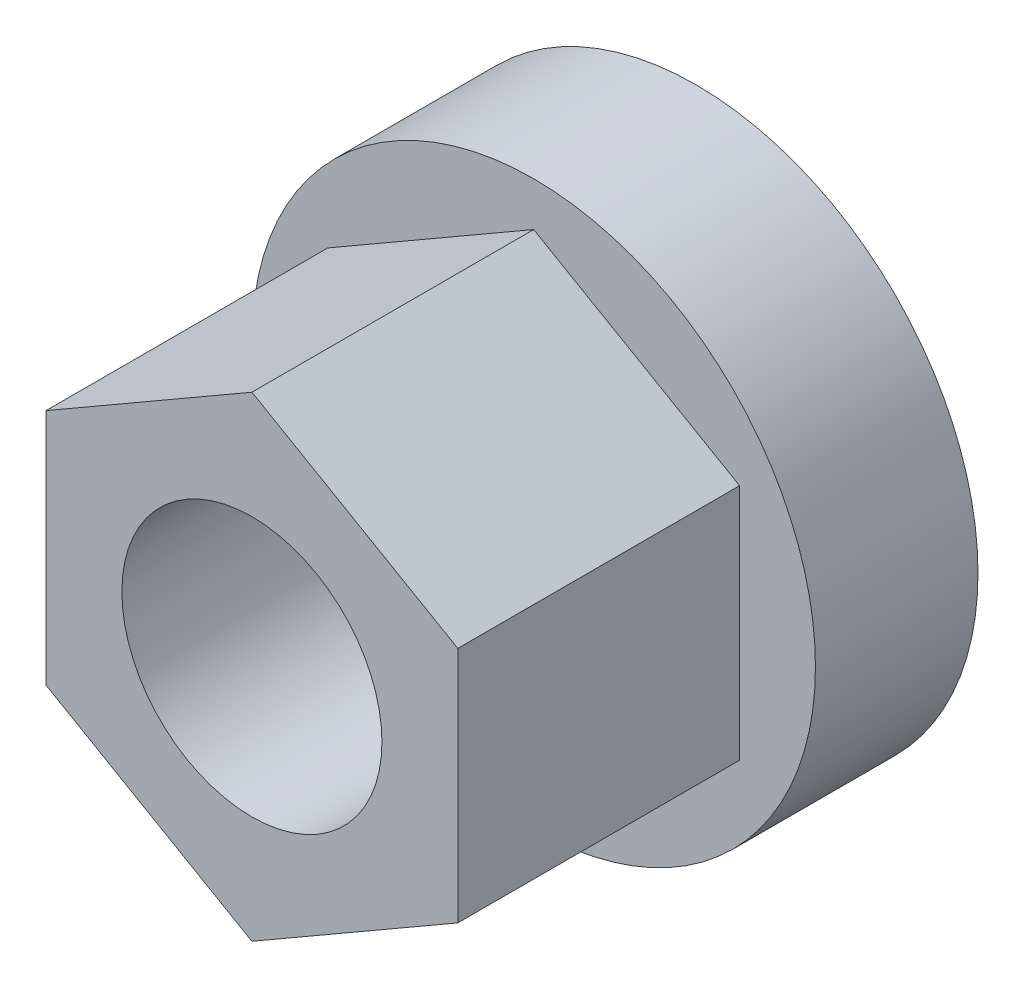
ISO-10303-21;
HEADER;
FILE_DESCRIPTION(('STEP AP214'),'2;1');
FILE_NAME('part.step','',(''),(''),'','','');
FILE_SCHEMA(('AUTOMOTIVE_DESIGN { 1 0 10303 214 1 1 1 1 }'));
ENDSEC;
DATA;
#1=APPLICATION_CONTEXT('core data for automotive mechanical design processes');
#2=APPLICATION_PROTOCOL_DEFINITION('international standard','automotive_design',2000,#1);
#3=PRODUCT_CONTEXT('',#1,'mechanical');
#4=PRODUCT('Part','Part','',(#3));
#5=PRODUCT_RELATED_PRODUCT_CATEGORY('part','',(#4));
#6=PRODUCT_DEFINITION_FORMATION('','',#4);
#7=PRODUCT_DEFINITION_CONTEXT('part definition',#1,'design');
#8=PRODUCT_DEFINITION('design','',#6,#7);
#9=PRODUCT_DEFINITION_SHAPE('','',#8);
#10=(LENGTH_UNIT() NAMED_UNIT(*) SI_UNIT(.MILLI.,.METRE.));
#11=(NAMED_UNIT(*) PLANE_ANGLE_UNIT() SI_UNIT($,.RADIAN.));
#12=(NAMED_UNIT(*) SI_UNIT($,.STERADIAN.) SOLID_ANGLE_UNIT());
#13=UNCERTAINTY_MEASURE_WITH_UNIT(LENGTH_MEASURE(1.E-05),#10,'distance_accuracy_value','');
#14=(GEOMETRIC_REPRESENTATION_CONTEXT(3) GLOBAL_UNCERTAINTY_ASSIGNED_CONTEXT((#13)) GLOBAL_UNIT_ASSIGNED_CONTEXT((#10,
#11,#12)) REPRESENTATION_CONTEXT('',''));
#15=CARTESIAN_POINT('',(0.,0.,0.));
#16=DIRECTION('',(0.,0.,1.));
#17=DIRECTION('',(1.,0.,0.));
#18=AXIS2_PLACEMENT_3D('',#15,#16,#17);
#19=CARTESIAN_POINT('',(-13.,0.,20.5));
#20=DIRECTION('',(0.,0.,-1.));
#21=DIRECTION('',(-1.,0.,0.));
#22=AXIS2_PLACEMENT_3D('',#19,#20,#21);
#23=PLANE('',#22);
#24=CARTESIAN_POINT('',(0.,0.,20.5));
#25=DIRECTION('',(0.,0.,1.));
#26=DIRECTION('',(1.,0.,0.));
#27=AXIS2_PLACEMENT_3D('',#24,#25,#26);
#28=CIRCLE('',#27,6.);
#29=CARTESIAN_POINT('',(6.,0.,20.5));
#30=VERTEX_POINT('',#29);
#31=EDGE_CURVE('E9',#30,#30,#28,.T.);
#32=ORIENTED_EDGE('',*,*,#31,.F.);
#33=EDGE_LOOP('',(#32));
#34=FACE_BOUND('',#33,.T.);
#35=DIRECTION('',(0.86602540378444,-0.5,0.));
#36=VECTOR('',#35,1.);
#37=CARTESIAN_POINT('',(-9.5,-5.4848275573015,20.5));
#38=LINE('',#37,#36);
#39=CARTESIAN_POINT('',(-9.5,-5.4848275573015,20.5));
#40=VERTEX_POINT('',#39);
#41=CARTESIAN_POINT('',(0.,-10.9696551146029,20.5));
#42=VERTEX_POINT('',#41);
#43=EDGE_CURVE('E87',#40,#42,#38,.T.);
#44=ORIENTED_EDGE('',*,*,#43,.T.);
#45=DIRECTION('',(0.866025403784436,0.5,0.));
#46=VECTOR('',#45,1.);
#47=CARTESIAN_POINT('',(0.,-10.9696551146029,20.5));
#48=LINE('',#47,#46);
#49=CARTESIAN_POINT('',(9.5,-5.48482755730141,20.5));
#50=VERTEX_POINT('',#49);
#51=EDGE_CURVE('E85',#42,#50,#48,.T.);
#52=ORIENTED_EDGE('',*,*,#51,.T.);
#53=DIRECTION('',(0.,1.,0.));
#54=VECTOR('',#53,1.);
#55=CARTESIAN_POINT('',(9.5,-5.48482755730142,20.5));
#56=LINE('',#55,#54);
#57=CARTESIAN_POINT('',(9.5,5.48482755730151,20.5));
#58=VERTEX_POINT('',#57);
#59=EDGE_CURVE('E29',#50,#58,#56,.T.);
#60=ORIENTED_EDGE('',*,*,#59,.T.);
#61=DIRECTION('',(-0.866025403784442,0.5,0.));
#62=VECTOR('',#61,1.);
#63=CARTESIAN_POINT('',(9.5,5.48482755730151,20.5));
#64=LINE('',#63,#62);
#65=CARTESIAN_POINT('',(0.,10.9696551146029,20.5));
#66=VERTEX_POINT('',#65);
#67=EDGE_CURVE('E75',#58,#66,#64,.T.);
#68=ORIENTED_EDGE('',*,*,#67,.T.);
#69=DIRECTION('',(-0.86602540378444,-0.5,0.));
#70=VECTOR('',#69,1.);
#71=CARTESIAN_POINT('',(0.,10.9696551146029,20.5));
#72=LINE('',#71,#70);
#73=CARTESIAN_POINT('',(-9.5,5.48482755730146,20.5));
#74=VERTEX_POINT('',#73);
#75=EDGE_CURVE('E80',#66,#74,#72,.T.);
#76=ORIENTED_EDGE('',*,*,#75,.T.);
#77=DIRECTION('',(0.,-1.,0.));
#78=VECTOR('',#77,1.);
#79=CARTESIAN_POINT('',(-9.5,5.48482755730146,20.5));
#80=LINE('',#79,#78);
#81=EDGE_CURVE('E108',#74,#40,#80,.T.);
#82=ORIENTED_EDGE('',*,*,#81,.T.);
#83=EDGE_LOOP('',(#44,#52,#60,#68,#76,#82));
#84=FACE_BOUND('',#83,.T.);
#85=ADVANCED_FACE('F14',(#34,#84),#23,.F.);
#86=CARTESIAN_POINT('',(0.,0.,20.));
#87=DIRECTION('',(0.,0.,1.));
#88=DIRECTION('',(1.,0.,0.));
#89=AXIS2_PLACEMENT_3D('',#86,#87,#88);
#90=CYLINDRICAL_SURFACE('',#89,13.);
#91=CARTESIAN_POINT('',(0.,0.,0.));
#92=DIRECTION('',(0.,0.,1.));
#93=DIRECTION('',(1.,0.,0.));
#94=AXIS2_PLACEMENT_3D('',#91,#92,#93);
#95=CIRCLE('',#94,13.);
#96=CARTESIAN_POINT('',(13.,0.,0.));
#97=VERTEX_POINT('',#96);
#98=EDGE_CURVE('E116',#97,#97,#95,.T.);
#99=ORIENTED_EDGE('',*,*,#98,.T.);
#100=EDGE_LOOP('',(#99));
#101=FACE_BOUND('',#100,.T.);
#102=CARTESIAN_POINT('',(0.,0.,7.5));
#103=DIRECTION('',(0.,0.,1.));
#104=DIRECTION('',(1.,0.,0.));
#105=AXIS2_PLACEMENT_3D('',#102,#103,#104);
#106=CIRCLE('',#105,13.);
#107=CARTESIAN_POINT('',(13.,0.,7.5));
#108=VERTEX_POINT('',#107);
#109=EDGE_CURVE('E17',#108,#108,#106,.T.);
#110=ORIENTED_EDGE('',*,*,#109,.F.);
#111=EDGE_LOOP('',(#110));
#112=FACE_BOUND('',#111,.T.);
#113=ADVANCED_FACE('F127',(#101,#112),#90,.T.);
#114=CARTESIAN_POINT('',(0.,0.,20.));
#115=DIRECTION('',(0.,0.,1.));
#116=DIRECTION('',(1.,0.,0.));
#117=AXIS2_PLACEMENT_3D('',#114,#115,#116);
#118=CYLINDRICAL_SURFACE('',#117,6.);
#119=CARTESIAN_POINT('',(0.,0.,0.));
#120=DIRECTION('',(0.,0.,1.));
#121=DIRECTION('',(1.,0.,0.));
#122=AXIS2_PLACEMENT_3D('',#119,#120,#121);
#123=CIRCLE('',#122,6.);
#124=CARTESIAN_POINT('',(6.,0.,0.));
#125=VERTEX_POINT('',#124);
#126=EDGE_CURVE('E22',#125,#125,#123,.T.);
#127=ORIENTED_EDGE('',*,*,#126,.F.);
#128=EDGE_LOOP('',(#127));
#129=FACE_BOUND('',#128,.T.);
#130=ORIENTED_EDGE('',*,*,#31,.T.);
#131=EDGE_LOOP('',(#130));
#132=FACE_BOUND('',#131,.T.);
#133=ADVANCED_FACE('F124',(#129,#132),#118,.F.);
#134=CARTESIAN_POINT('',(-6.,0.,0.));
#135=DIRECTION('',(0.,0.,1.));
#136=DIRECTION('',(1.,0.,0.));
#137=AXIS2_PLACEMENT_3D('',#134,#135,#136);
#138=PLANE('',#137);
#139=ORIENTED_EDGE('',*,*,#98,.F.);
#140=EDGE_LOOP('',(#139));
#141=FACE_BOUND('',#140,.T.);
#142=ORIENTED_EDGE('',*,*,#126,.T.);
#143=EDGE_LOOP('',(#142));
#144=FACE_BOUND('',#143,.T.);
#145=ADVANCED_FACE('F122',(#141,#144),#138,.F.);
#146=CARTESIAN_POINT('',(0.,0.,7.5));
#147=DIRECTION('',(0.,0.,1.));
#148=DIRECTION('',(1.,0.,0.));
#149=AXIS2_PLACEMENT_3D('',#146,#147,#148);
#150=PLANE('',#149);
#151=DIRECTION('',(0.,-1.,0.));
#152=VECTOR('',#151,1.);
#153=CARTESIAN_POINT('',(-9.5,5.48482755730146,7.5));
#154=LINE('',#153,#152);
#155=CARTESIAN_POINT('',(-9.5,5.48482755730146,7.5));
#156=VERTEX_POINT('',#155);
#157=CARTESIAN_POINT('',(-9.5,-5.4848275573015,7.5));
#158=VERTEX_POINT('',#157);
#159=EDGE_CURVE('E92',#156,#158,#154,.T.);
#160=ORIENTED_EDGE('',*,*,#159,.F.);
#161=DIRECTION('',(-0.86602540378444,-0.5,0.));
#162=VECTOR('',#161,1.);
#163=CARTESIAN_POINT('',(0.,10.9696551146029,7.5));
#164=LINE('',#163,#162);
#165=CARTESIAN_POINT('',(0.,10.9696551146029,7.5));
#166=VERTEX_POINT('',#165);
#167=EDGE_CURVE('E96',#166,#156,#164,.T.);
#168=ORIENTED_EDGE('',*,*,#167,.F.);
#169=DIRECTION('',(-0.866025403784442,0.5,0.));
#170=VECTOR('',#169,1.);
#171=CARTESIAN_POINT('',(9.5,5.48482755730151,7.5));
#172=LINE('',#171,#170);
#173=CARTESIAN_POINT('',(9.5,5.48482755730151,7.5));
#174=VERTEX_POINT('',#173);
#175=EDGE_CURVE('E99',#174,#166,#172,.T.);
#176=ORIENTED_EDGE('',*,*,#175,.F.);
#177=DIRECTION('',(0.,1.,0.));
#178=VECTOR('',#177,1.);
#179=CARTESIAN_POINT('',(9.5,-5.48482755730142,7.5));
#180=LINE('',#179,#178);
#181=CARTESIAN_POINT('',(9.5,-5.48482755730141,7.5));
#182=VERTEX_POINT('',#181);
#183=EDGE_CURVE('E37',#182,#174,#180,.T.);
#184=ORIENTED_EDGE('',*,*,#183,.F.);
#185=DIRECTION('',(0.866025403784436,0.5,0.));
#186=VECTOR('',#185,1.);
#187=CARTESIAN_POINT('',(0.,-10.9696551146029,7.5));
#188=LINE('',#187,#186);
#189=CARTESIAN_POINT('',(0.,-10.9696551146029,7.5));
#190=VERTEX_POINT('',#189);
#191=EDGE_CURVE('E102',#190,#182,#188,.T.);
#192=ORIENTED_EDGE('',*,*,#191,.F.);
#193=DIRECTION('',(0.86602540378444,-0.5,0.));
#194=VECTOR('',#193,1.);
#195=CARTESIAN_POINT('',(-9.5,-5.4848275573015,7.5));
#196=LINE('',#195,#194);
#197=EDGE_CURVE('E105',#158,#190,#196,.T.);
#198=ORIENTED_EDGE('',*,*,#197,.F.);
#199=EDGE_LOOP('',(#160,#168,#176,#184,#192,#198));
#200=FACE_BOUND('',#199,.T.);
#201=ORIENTED_EDGE('',*,*,#109,.T.);
#202=EDGE_LOOP('',(#201));
#203=FACE_BOUND('',#202,.T.);
#204=ADVANCED_FACE('F144',(#200,#203),#150,.T.);
#205=CARTESIAN_POINT('',(-9.5,-5.4848275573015,7.5));
#206=DIRECTION('',(-0.5,-0.86602540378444,0.));
#207=DIRECTION('',(0.86602540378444,-0.5,0.));
#208=AXIS2_PLACEMENT_3D('',#205,#206,#207);
#209=PLANE('',#208);
#210=DIRECTION('',(0.,0.,1.));
#211=VECTOR('',#210,1.);
#212=CARTESIAN_POINT('',(-9.5,-5.4848275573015,7.5));
#213=LINE('',#212,#211);
#214=EDGE_CURVE('E114',#158,#40,#213,.T.);
#215=ORIENTED_EDGE('',*,*,#214,.F.);
#216=ORIENTED_EDGE('',*,*,#197,.T.);
#217=DIRECTION('',(0.,0.,1.));
#218=VECTOR('',#217,1.);
#219=CARTESIAN_POINT('',(0.,-10.9696551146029,7.5));
#220=LINE('',#219,#218);
#221=EDGE_CURVE('E95',#190,#42,#220,.T.);
#222=ORIENTED_EDGE('',*,*,#221,.T.);
#223=ORIENTED_EDGE('',*,*,#43,.F.);
#224=EDGE_LOOP('',(#215,#216,#222,#223));
#225=FACE_BOUND('',#224,.T.);
#226=ADVANCED_FACE('F152',(#225),#209,.T.);
#227=CARTESIAN_POINT('',(-9.5,5.48482755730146,7.5));
#228=DIRECTION('',(-1.,0.,0.));
#229=DIRECTION('',(0.,-1.,0.));
#230=AXIS2_PLACEMENT_3D('',#227,#228,#229);
#231=PLANE('',#230);
#232=DIRECTION('',(0.,0.,1.));
#233=VECTOR('',#232,1.);
#234=CARTESIAN_POINT('',(-9.5,5.48482755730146,7.5));
#235=LINE('',#234,#233);
#236=EDGE_CURVE('E112',#156,#74,#235,.T.);
#237=ORIENTED_EDGE('',*,*,#236,.F.);
#238=ORIENTED_EDGE('',*,*,#159,.T.);
#239=ORIENTED_EDGE('',*,*,#214,.T.);
#240=ORIENTED_EDGE('',*,*,#81,.F.);
#241=EDGE_LOOP('',(#237,#238,#239,#240));
#242=FACE_BOUND('',#241,.T.);
#243=ADVANCED_FACE('F158',(#242),#231,.T.);
#244=CARTESIAN_POINT('',(0.,10.9696551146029,7.5));
#245=DIRECTION('',(-0.5,0.86602540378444,0.));
#246=DIRECTION('',(-0.86602540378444,-0.5,0.));
#247=AXIS2_PLACEMENT_3D('',#244,#245,#246);
#248=PLANE('',#247);
#249=DIRECTION('',(0.,0.,1.));
#250=VECTOR('',#249,1.);
#251=CARTESIAN_POINT('',(0.,10.9696551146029,7.5));
#252=LINE('',#251,#250);
#253=EDGE_CURVE('E71',#166,#66,#252,.T.);
#254=ORIENTED_EDGE('',*,*,#253,.F.);
#255=ORIENTED_EDGE('',*,*,#167,.T.);
#256=ORIENTED_EDGE('',*,*,#236,.T.);
#257=ORIENTED_EDGE('',*,*,#75,.F.);
#258=EDGE_LOOP('',(#254,#255,#256,#257));
#259=FACE_BOUND('',#258,.T.);
#260=ADVANCED_FACE('F169',(#259),#248,.T.);
#261=CARTESIAN_POINT('',(9.5,5.48482755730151,7.5));
#262=DIRECTION('',(0.5,0.866025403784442,0.));
#263=DIRECTION('',(-0.866025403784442,0.5,0.));
#264=AXIS2_PLACEMENT_3D('',#261,#262,#263);
#265=PLANE('',#264);
#266=DIRECTION('',(0.,0.,1.));
#267=VECTOR('',#266,1.);
#268=CARTESIAN_POINT('',(9.5,5.48482755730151,7.5));
#269=LINE('',#268,#267);
#270=EDGE_CURVE('E66',#174,#58,#269,.T.);
#271=ORIENTED_EDGE('',*,*,#270,.F.);
#272=ORIENTED_EDGE('',*,*,#175,.T.);
#273=ORIENTED_EDGE('',*,*,#253,.T.);
#274=ORIENTED_EDGE('',*,*,#67,.F.);
#275=EDGE_LOOP('',(#271,#272,#273,#274));
#276=FACE_BOUND('',#275,.T.);
#277=ADVANCED_FACE('F76',(#276),#265,.T.);
#278=CARTESIAN_POINT('',(9.5,-5.48482755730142,7.5));
#279=DIRECTION('',(1.,0.,0.));
#280=DIRECTION('',(0.,1.,0.));
#281=AXIS2_PLACEMENT_3D('',#278,#279,#280);
#282=PLANE('',#281);
#283=DIRECTION('',(0.,0.,1.));
#284=VECTOR('',#283,1.);
#285=CARTESIAN_POINT('',(9.5,-5.48482755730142,7.5));
#286=LINE('',#285,#284);
#287=EDGE_CURVE('E72',#182,#50,#286,.T.);
#288=ORIENTED_EDGE('',*,*,#287,.F.);
#289=ORIENTED_EDGE('',*,*,#183,.T.);
#290=ORIENTED_EDGE('',*,*,#270,.T.);
#291=ORIENTED_EDGE('',*,*,#59,.F.);
#292=EDGE_LOOP('',(#288,#289,#290,#291));
#293=FACE_BOUND('',#292,.T.);
#294=ADVANCED_FACE('F68',(#293),#282,.T.);
#295=CARTESIAN_POINT('',(0.,-10.9696551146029,7.5));
#296=DIRECTION('',(0.5,-0.866025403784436,0.));
#297=DIRECTION('',(0.866025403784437,0.5,0.));
#298=AXIS2_PLACEMENT_3D('',#295,#296,#297);
#299=PLANE('',#298);
#300=ORIENTED_EDGE('',*,*,#191,.T.);
#301=ORIENTED_EDGE('',*,*,#287,.T.);
#302=ORIENTED_EDGE('',*,*,#51,.F.);
#303=ORIENTED_EDGE('',*,*,#221,.F.);
#304=EDGE_LOOP('',(#300,#301,#302,#303));
#305=FACE_BOUND('',#304,.T.);
#306=ADVANCED_FACE('F175',(#305),#299,.T.);
#307=CLOSED_SHELL('',(#85,#113,#133,#145,#204,#226,#243,#260,#277,#294,#306));
#308=MANIFOLD_SOLID_BREP('B1',#307);
#309=ADVANCED_BREP_SHAPE_REPRESENTATION('',(#18,#308),#14);
#310=SHAPE_DEFINITION_REPRESENTATION(#9,#309);
ENDSEC;
END-ISO-10303-21;
